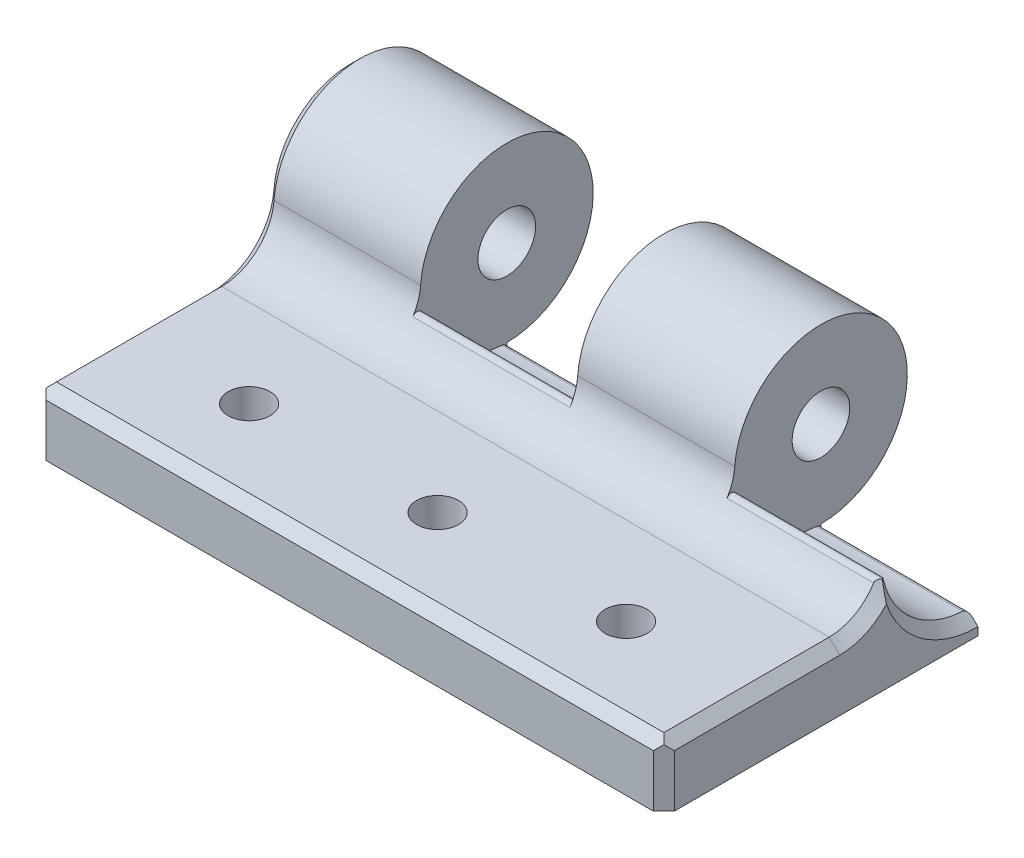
ISO-10303-21;
HEADER;
FILE_DESCRIPTION(('STEP AP214'),'2;1');
FILE_NAME('part.step','',(''),(''),'','','');
FILE_SCHEMA(('AUTOMOTIVE_DESIGN { 1 0 10303 214 1 1 1 1 }'));
ENDSEC;
DATA;
#1=APPLICATION_CONTEXT('core data for automotive mechanical design processes');
#2=APPLICATION_PROTOCOL_DEFINITION('international standard','automotive_design',2000,#1);
#3=PRODUCT_CONTEXT('',#1,'mechanical');
#4=PRODUCT('Part','Part','',(#3));
#5=PRODUCT_RELATED_PRODUCT_CATEGORY('part','',(#4));
#6=PRODUCT_DEFINITION_FORMATION('','',#4);
#7=PRODUCT_DEFINITION_CONTEXT('part definition',#1,'design');
#8=PRODUCT_DEFINITION('design','',#6,#7);
#9=PRODUCT_DEFINITION_SHAPE('','',#8);
#10=(LENGTH_UNIT() NAMED_UNIT(*) SI_UNIT(.MILLI.,.METRE.));
#11=(NAMED_UNIT(*) PLANE_ANGLE_UNIT() SI_UNIT($,.RADIAN.));
#12=(NAMED_UNIT(*) SI_UNIT($,.STERADIAN.) SOLID_ANGLE_UNIT());
#13=UNCERTAINTY_MEASURE_WITH_UNIT(LENGTH_MEASURE(1.E-05),#10,'distance_accuracy_value','');
#14=(GEOMETRIC_REPRESENTATION_CONTEXT(3) GLOBAL_UNCERTAINTY_ASSIGNED_CONTEXT((#13)) GLOBAL_UNIT_ASSIGNED_CONTEXT((#10,
#11,#12)) REPRESENTATION_CONTEXT('',''));
#15=CARTESIAN_POINT('',(0.,0.,0.));
#16=DIRECTION('',(0.,0.,1.));
#17=DIRECTION('',(1.,0.,0.));
#18=AXIS2_PLACEMENT_3D('',#15,#16,#17);
#19=CARTESIAN_POINT('',(30.,0.,0.));
#20=DIRECTION('',(-1.,0.,0.));
#21=DIRECTION('',(0.,0.,1.));
#22=AXIS2_PLACEMENT_3D('',#19,#20,#21);
#23=CYLINDRICAL_SURFACE('',#22,8.25);
#24=CARTESIAN_POINT('',(15.,0.,0.));
#25=DIRECTION('',(1.,0.,0.));
#26=DIRECTION('',(0.,0.,-1.));
#27=AXIS2_PLACEMENT_3D('',#24,#25,#26);
#28=CIRCLE('',#27,8.25);
#29=CARTESIAN_POINT('',(15.,-8.25,0.));
#30=VERTEX_POINT('',#29);
#31=CARTESIAN_POINT('',(15.,0.62264150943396,8.2264705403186));
#32=VERTEX_POINT('',#31);
#33=EDGE_CURVE('E206',#30,#32,#28,.T.);
#34=ORIENTED_EDGE('',*,*,#33,.F.);
#35=DIRECTION('',(-1.,0.,0.));
#36=VECTOR('',#35,1.);
#37=CARTESIAN_POINT('',(30.,-8.25,0.));
#38=LINE('',#37,#36);
#39=CARTESIAN_POINT('',(0.,-8.25,0.));
#40=VERTEX_POINT('',#39);
#41=EDGE_CURVE('E394',#30,#40,#38,.T.);
#42=ORIENTED_EDGE('',*,*,#41,.T.);
#43=CARTESIAN_POINT('',(0.,0.,0.));
#44=DIRECTION('',(-1.,0.,0.));
#45=DIRECTION('',(0.,0.,1.));
#46=AXIS2_PLACEMENT_3D('',#43,#44,#45);
#47=CIRCLE('',#46,8.25);
#48=CARTESIAN_POINT('',(0.,0.62264150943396,8.2264705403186));
#49=VERTEX_POINT('',#48);
#50=EDGE_CURVE('E213',#49,#40,#47,.T.);
#51=ORIENTED_EDGE('',*,*,#50,.F.);
#52=DIRECTION('',(-1.,0.,0.));
#53=VECTOR('',#52,1.);
#54=CARTESIAN_POINT('',(30.,0.62264150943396,8.2264705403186));
#55=LINE('',#54,#53);
#56=EDGE_CURVE('E198',#32,#49,#55,.T.);
#57=ORIENTED_EDGE('',*,*,#56,.F.);
#58=EDGE_LOOP('',(#34,#42,#51,#57));
#59=FACE_BOUND('',#58,.T.);
#60=ADVANCED_FACE('F33',(#59),#23,.T.);
#61=CARTESIAN_POINT('',(30.,0.,0.));
#62=DIRECTION('',(-1.,0.,0.));
#63=DIRECTION('',(0.,0.,1.));
#64=AXIS2_PLACEMENT_3D('',#61,#62,#63);
#65=CYLINDRICAL_SURFACE('',#64,2.75);
#66=CARTESIAN_POINT('',(0.,0.,0.));
#67=DIRECTION('',(-1.,0.,0.));
#68=DIRECTION('',(0.,0.,1.));
#69=AXIS2_PLACEMENT_3D('',#66,#67,#68);
#70=CIRCLE('',#69,2.75);
#71=CARTESIAN_POINT('',(0.,0.,2.75));
#72=VERTEX_POINT('',#71);
#73=EDGE_CURVE('E271',#72,#72,#70,.T.);
#74=ORIENTED_EDGE('',*,*,#73,.T.);
#75=EDGE_LOOP('',(#74));
#76=FACE_BOUND('',#75,.T.);
#77=CARTESIAN_POINT('',(15.,0.,0.));
#78=DIRECTION('',(1.,0.,0.));
#79=DIRECTION('',(0.,0.,-1.));
#80=AXIS2_PLACEMENT_3D('',#77,#78,#79);
#81=CIRCLE('',#80,2.75);
#82=CARTESIAN_POINT('',(15.,0.,-2.75));
#83=VERTEX_POINT('',#82);
#84=EDGE_CURVE('E769',#83,#83,#81,.T.);
#85=ORIENTED_EDGE('',*,*,#84,.T.);
#86=EDGE_LOOP('',(#85));
#87=FACE_BOUND('',#86,.T.);
#88=ADVANCED_FACE('F509',(#76,#87),#65,.F.);
#89=CARTESIAN_POINT('',(30.,0.,0.));
#90=DIRECTION('',(1.,0.,0.));
#91=DIRECTION('',(0.,0.,-1.));
#92=AXIS2_PLACEMENT_3D('',#89,#90,#91);
#93=PLANE('',#92);
#94=DIRECTION('',(0.,0.,1.));
#95=VECTOR('',#94,1.);
#96=CARTESIAN_POINT('',(30.,-5.,30.));
#97=LINE('',#96,#95);
#98=CARTESIAN_POINT('',(30.,-5.,13.2122102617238));
#99=VERTEX_POINT('',#98);
#100=CARTESIAN_POINT('',(30.,-5.,29.));
#101=VERTEX_POINT('',#100);
#102=EDGE_CURVE('E243',#99,#101,#97,.T.);
#103=ORIENTED_EDGE('',*,*,#102,.T.);
#104=DIRECTION('',(0.,-1.,0.));
#105=VECTOR('',#104,1.);
#106=CARTESIAN_POINT('',(30.,-10.,29.));
#107=LINE('',#106,#105);
#108=CARTESIAN_POINT('',(30.,-10.,29.));
#109=VERTEX_POINT('',#108);
#110=EDGE_CURVE('E304',#101,#109,#107,.T.);
#111=ORIENTED_EDGE('',*,*,#110,.T.);
#112=DIRECTION('',(0.,0.,-1.));
#113=VECTOR('',#112,1.);
#114=CARTESIAN_POINT('',(30.,-10.,0.));
#115=LINE('',#114,#113);
#116=CARTESIAN_POINT('',(30.,-10.,0.));
#117=VERTEX_POINT('',#116);
#118=EDGE_CURVE('E451',#109,#117,#115,.T.);
#119=ORIENTED_EDGE('',*,*,#118,.T.);
#120=DIRECTION('',(0.,1.,0.));
#121=VECTOR('',#120,1.);
#122=CARTESIAN_POINT('',(30.,-8.25,0.));
#123=LINE('',#122,#121);
#124=CARTESIAN_POINT('',(30.,-9.24999999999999,0.));
#125=VERTEX_POINT('',#124);
#126=EDGE_CURVE('E441',#117,#125,#123,.T.);
#127=ORIENTED_EDGE('',*,*,#126,.T.);
#128=CARTESIAN_POINT('',(30.,0.,0.));
#129=DIRECTION('',(1.,0.,0.));
#130=DIRECTION('',(0.,0.,-1.));
#131=AXIS2_PLACEMENT_3D('',#128,#129,#130);
#132=CIRCLE('',#131,9.24999999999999);
#133=CARTESIAN_POINT('',(30.,-3.0080084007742,8.7472501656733));
#134=VERTEX_POINT('',#133);
#135=EDGE_CURVE('E302',#125,#134,#132,.F.);
#136=ORIENTED_EDGE('',*,*,#135,.T.);
#137=CARTESIAN_POINT('',(30.,0.999999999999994,13.2122102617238));
#138=DIRECTION('',(1.,0.,0.));
#139=DIRECTION('',(0.,0.,-1.));
#140=AXIS2_PLACEMENT_3D('',#137,#138,#139);
#141=CIRCLE('',#140,5.99999999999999);
#142=EDGE_CURVE('E246',#134,#99,#141,.F.);
#143=ORIENTED_EDGE('',*,*,#142,.T.);
#144=EDGE_LOOP('',(#103,#111,#119,#127,#136,#143));
#145=FACE_BOUND('',#144,.T.);
#146=ADVANCED_FACE('F483',(#145),#93,.T.);
#147=CARTESIAN_POINT('',(-30.,0.,0.));
#148=DIRECTION('',(1.,0.,0.));
#149=DIRECTION('',(0.,0.,-1.));
#150=AXIS2_PLACEMENT_3D('',#147,#148,#149);
#151=PLANE('',#150);
#152=DIRECTION('',(0.,0.,-1.));
#153=VECTOR('',#152,1.);
#154=CARTESIAN_POINT('',(-30.,-10.,0.));
#155=LINE('',#154,#153);
#156=CARTESIAN_POINT('',(-30.,-10.,29.));
#157=VERTEX_POINT('',#156);
#158=CARTESIAN_POINT('',(-30.,-10.,0.));
#159=VERTEX_POINT('',#158);
#160=EDGE_CURVE('E452',#157,#159,#155,.T.);
#161=ORIENTED_EDGE('',*,*,#160,.F.);
#162=DIRECTION('',(0.,1.,0.));
#163=VECTOR('',#162,1.);
#164=CARTESIAN_POINT('',(-30.,0.,29.));
#165=LINE('',#164,#163);
#166=CARTESIAN_POINT('',(-30.,-5.,29.));
#167=VERTEX_POINT('',#166);
#168=EDGE_CURVE('E294',#157,#167,#165,.T.);
#169=ORIENTED_EDGE('',*,*,#168,.T.);
#170=DIRECTION('',(0.,0.,-1.));
#171=VECTOR('',#170,1.);
#172=CARTESIAN_POINT('',(-30.,-5.,0.));
#173=LINE('',#172,#171);
#174=CARTESIAN_POINT('',(-30.,-5.,13.2122102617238));
#175=VERTEX_POINT('',#174);
#176=EDGE_CURVE('E218',#167,#175,#173,.T.);
#177=ORIENTED_EDGE('',*,*,#176,.T.);
#178=CARTESIAN_POINT('',(-30.,0.999999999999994,13.2122102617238));
#179=DIRECTION('',(1.,0.,0.));
#180=DIRECTION('',(0.,0.,-1.));
#181=AXIS2_PLACEMENT_3D('',#178,#179,#180);
#182=CIRCLE('',#181,5.99999999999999);
#183=CARTESIAN_POINT('',(-30.,0.547169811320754,7.22932259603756));
#184=VERTEX_POINT('',#183);
#185=EDGE_CURVE('E238',#175,#184,#182,.T.);
#186=ORIENTED_EDGE('',*,*,#185,.T.);
#187=CARTESIAN_POINT('',(-30.,0.,0.));
#188=DIRECTION('',(1.,0.,0.));
#189=DIRECTION('',(0.,0.,-1.));
#190=AXIS2_PLACEMENT_3D('',#187,#188,#189);
#191=CIRCLE('',#190,7.25000000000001);
#192=CARTESIAN_POINT('',(-30.,-7.25000000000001,0.));
#193=VERTEX_POINT('',#192);
#194=EDGE_CURVE('E240',#184,#193,#191,.F.);
#195=ORIENTED_EDGE('',*,*,#194,.T.);
#196=DIRECTION('',(0.,1.,0.));
#197=VECTOR('',#196,1.);
#198=CARTESIAN_POINT('',(-30.,-8.25,0.));
#199=LINE('',#198,#197);
#200=EDGE_CURVE('E445',#159,#193,#199,.T.);
#201=ORIENTED_EDGE('',*,*,#200,.F.);
#202=EDGE_LOOP('',(#161,#169,#177,#186,#195,#201));
#203=FACE_BOUND('',#202,.T.);
#204=CARTESIAN_POINT('',(-30.,0.,0.));
#205=DIRECTION('',(1.,0.,0.));
#206=DIRECTION('',(0.,0.,-1.));
#207=AXIS2_PLACEMENT_3D('',#204,#205,#206);
#208=CIRCLE('',#207,2.75);
#209=CARTESIAN_POINT('',(-30.,0.,-2.75));
#210=VERTEX_POINT('',#209);
#211=EDGE_CURVE('E227',#210,#210,#208,.T.);
#212=ORIENTED_EDGE('',*,*,#211,.T.);
#213=EDGE_LOOP('',(#212));
#214=FACE_BOUND('',#213,.T.);
#215=ADVANCED_FACE('F454',(#203,#214),#151,.F.);
#216=CARTESIAN_POINT('',(-15.,0.62264150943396,8.2264705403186));
#217=VERTEX_POINT('',#216);
#218=CARTESIAN_POINT('',(-29.,0.62264150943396,8.2264705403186));
#219=VERTEX_POINT('',#218);
#220=EDGE_CURVE('E215',#217,#219,#55,.T.);
#221=ORIENTED_EDGE('',*,*,#220,.F.);
#222=CARTESIAN_POINT('',(-15.,0.,0.));
#223=DIRECTION('',(-1.,0.,0.));
#224=DIRECTION('',(0.,0.,1.));
#225=AXIS2_PLACEMENT_3D('',#222,#223,#224);
#226=CIRCLE('',#225,8.25);
#227=CARTESIAN_POINT('',(-15.,-8.25,0.));
#228=VERTEX_POINT('',#227);
#229=EDGE_CURVE('E424',#217,#228,#226,.T.);
#230=ORIENTED_EDGE('',*,*,#229,.T.);
#231=CARTESIAN_POINT('',(-29.,-8.25,0.));
#232=VERTEX_POINT('',#231);
#233=EDGE_CURVE('E383',#228,#232,#38,.T.);
#234=ORIENTED_EDGE('',*,*,#233,.T.);
#235=CARTESIAN_POINT('',(-29.,0.,0.));
#236=DIRECTION('',(1.,0.,0.));
#237=DIRECTION('',(0.,0.,-1.));
#238=AXIS2_PLACEMENT_3D('',#235,#236,#237);
#239=CIRCLE('',#238,8.25);
#240=EDGE_CURVE('E214',#232,#219,#239,.T.);
#241=ORIENTED_EDGE('',*,*,#240,.T.);
#242=EDGE_LOOP('',(#221,#230,#234,#241));
#243=FACE_BOUND('',#242,.T.);
#244=ADVANCED_FACE('F440',(#243),#23,.T.);
#245=CARTESIAN_POINT('',(30.,0.999999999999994,13.2122102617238));
#246=DIRECTION('',(-1.,0.,0.));
#247=DIRECTION('',(0.,0.,1.));
#248=AXIS2_PLACEMENT_3D('',#245,#246,#247);
#249=CYLINDRICAL_SURFACE('',#248,5.);
#250=DIRECTION('',(-1.,0.,0.));
#251=VECTOR('',#250,1.);
#252=CARTESIAN_POINT('',(30.,-1.63888739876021,8.96529687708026));
#253=LINE('',#252,#251);
#254=CARTESIAN_POINT('',(0.,-1.63888739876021,8.96529687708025));
#255=VERTEX_POINT('',#254);
#256=CARTESIAN_POINT('',(-15.,-1.63888739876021,8.96529687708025));
#257=VERTEX_POINT('',#256);
#258=EDGE_CURVE('E413',#255,#257,#253,.T.);
#259=ORIENTED_EDGE('',*,*,#258,.T.);
#260=CARTESIAN_POINT('',(-15.,0.999999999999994,13.2122102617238));
#261=DIRECTION('',(-1.,0.,0.));
#262=DIRECTION('',(0.,0.,1.));
#263=AXIS2_PLACEMENT_3D('',#260,#261,#262);
#264=CIRCLE('',#263,5.);
#265=EDGE_CURVE('E408',#257,#217,#264,.F.);
#266=ORIENTED_EDGE('',*,*,#265,.T.);
#267=ORIENTED_EDGE('',*,*,#220,.T.);
#268=CARTESIAN_POINT('',(-29.,0.999999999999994,13.2122102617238));
#269=DIRECTION('',(1.,0.,0.));
#270=DIRECTION('',(0.,0.,-1.));
#271=AXIS2_PLACEMENT_3D('',#268,#269,#270);
#272=CIRCLE('',#271,5.);
#273=CARTESIAN_POINT('',(-29.,-4.,13.2122102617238));
#274=VERTEX_POINT('',#273);
#275=EDGE_CURVE('E250',#219,#274,#272,.F.);
#276=ORIENTED_EDGE('',*,*,#275,.T.);
#277=DIRECTION('',(-1.,0.,0.));
#278=VECTOR('',#277,1.);
#279=CARTESIAN_POINT('',(30.,-4.,13.2122102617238));
#280=LINE('',#279,#278);
#281=CARTESIAN_POINT('',(29.,-4.,13.2122102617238));
#282=VERTEX_POINT('',#281);
#283=EDGE_CURVE('E220',#282,#274,#280,.T.);
#284=ORIENTED_EDGE('',*,*,#283,.F.);
#285=CARTESIAN_POINT('',(29.,0.999999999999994,13.2122102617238));
#286=DIRECTION('',(1.,0.,0.));
#287=DIRECTION('',(0.,0.,-1.));
#288=AXIS2_PLACEMENT_3D('',#285,#286,#287);
#289=CIRCLE('',#288,5.);
#290=CARTESIAN_POINT('',(29.,-1.63888739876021,8.96529687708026));
#291=VERTEX_POINT('',#290);
#292=EDGE_CURVE('E248',#282,#291,#289,.T.);
#293=ORIENTED_EDGE('',*,*,#292,.T.);
#294=DIRECTION('',(-1.,0.,0.));
#295=VECTOR('',#294,1.);
#296=CARTESIAN_POINT('',(30.,-1.63888739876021,8.96529687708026));
#297=LINE('',#296,#295);
#298=CARTESIAN_POINT('',(15.,-1.63888739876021,8.96529687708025));
#299=VERTEX_POINT('',#298);
#300=EDGE_CURVE('E202',#291,#299,#297,.T.);
#301=ORIENTED_EDGE('',*,*,#300,.T.);
#302=CARTESIAN_POINT('',(15.,0.999999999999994,13.2122102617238));
#303=DIRECTION('',(1.,0.,0.));
#304=DIRECTION('',(0.,0.,-1.));
#305=AXIS2_PLACEMENT_3D('',#302,#303,#304);
#306=CIRCLE('',#305,5.);
#307=EDGE_CURVE('E193',#299,#32,#306,.T.);
#308=ORIENTED_EDGE('',*,*,#307,.T.);
#309=ORIENTED_EDGE('',*,*,#56,.T.);
#310=CARTESIAN_POINT('',(0.,0.999999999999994,13.2122102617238));
#311=DIRECTION('',(-1.,0.,0.));
#312=DIRECTION('',(0.,0.,1.));
#313=AXIS2_PLACEMENT_3D('',#310,#311,#312);
#314=CIRCLE('',#313,5.);
#315=EDGE_CURVE('E417',#49,#255,#314,.T.);
#316=ORIENTED_EDGE('',*,*,#315,.T.);
#317=EDGE_LOOP('',(#259,#266,#267,#276,#284,#293,#301,#308,#309,#316));
#318=FACE_BOUND('',#317,.T.);
#319=ADVANCED_FACE('F195',(#318),#249,.F.);
#320=CARTESIAN_POINT('',(30.,-4.,13.2122102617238));
#321=DIRECTION('',(0.,-1.,0.));
#322=DIRECTION('',(0.,0.,-1.));
#323=AXIS2_PLACEMENT_3D('',#320,#321,#322);
#324=PLANE('',#323);
#325=ORIENTED_EDGE('',*,*,#283,.T.);
#326=DIRECTION('',(0.,0.,1.));
#327=VECTOR('',#326,1.);
#328=CARTESIAN_POINT('',(-29.,-4.,13.2122102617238));
#329=LINE('',#328,#327);
#330=CARTESIAN_POINT('',(-29.,-4.,29.));
#331=VERTEX_POINT('',#330);
#332=EDGE_CURVE('E257',#274,#331,#329,.T.);
#333=ORIENTED_EDGE('',*,*,#332,.T.);
#334=DIRECTION('',(1.,0.,0.));
#335=VECTOR('',#334,1.);
#336=CARTESIAN_POINT('',(30.,-4.,29.));
#337=LINE('',#336,#335);
#338=CARTESIAN_POINT('',(29.,-4.,29.));
#339=VERTEX_POINT('',#338);
#340=EDGE_CURVE('E252',#331,#339,#337,.T.);
#341=ORIENTED_EDGE('',*,*,#340,.T.);
#342=DIRECTION('',(0.,0.,-1.));
#343=VECTOR('',#342,1.);
#344=CARTESIAN_POINT('',(29.,-4.,13.2122102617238));
#345=LINE('',#344,#343);
#346=EDGE_CURVE('E255',#339,#282,#345,.T.);
#347=ORIENTED_EDGE('',*,*,#346,.T.);
#348=EDGE_LOOP('',(#325,#333,#341,#347));
#349=FACE_BOUND('',#348,.T.);
#350=CARTESIAN_POINT('',(18.,-4.,21.6061051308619));
#351=DIRECTION('',(0.,1.,0.));
#352=DIRECTION('',(0.,0.,1.));
#353=AXIS2_PLACEMENT_3D('',#350,#351,#352);
#354=CIRCLE('',#353,2.);
#355=CARTESIAN_POINT('',(18.,-4.,23.6061051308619));
#356=VERTEX_POINT('',#355);
#357=EDGE_CURVE('E235',#356,#356,#354,.T.);
#358=ORIENTED_EDGE('',*,*,#357,.F.);
#359=EDGE_LOOP('',(#358));
#360=FACE_BOUND('',#359,.T.);
#361=CARTESIAN_POINT('',(0.,-4.,21.6061051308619));
#362=DIRECTION('',(0.,1.,0.));
#363=DIRECTION('',(0.,0.,1.));
#364=AXIS2_PLACEMENT_3D('',#361,#362,#363);
#365=CIRCLE('',#364,2.);
#366=CARTESIAN_POINT('',(0.,-4.,23.6061051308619));
#367=VERTEX_POINT('',#366);
#368=EDGE_CURVE('E232',#367,#367,#365,.T.);
#369=ORIENTED_EDGE('',*,*,#368,.F.);
#370=EDGE_LOOP('',(#369));
#371=FACE_BOUND('',#370,.T.);
#372=CARTESIAN_POINT('',(-18.,-4.,21.6061051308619));
#373=DIRECTION('',(0.,1.,0.));
#374=DIRECTION('',(0.,0.,1.));
#375=AXIS2_PLACEMENT_3D('',#372,#373,#374);
#376=CIRCLE('',#375,2.);
#377=CARTESIAN_POINT('',(-18.,-4.,23.6061051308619));
#378=VERTEX_POINT('',#377);
#379=EDGE_CURVE('E228',#378,#378,#376,.T.);
#380=ORIENTED_EDGE('',*,*,#379,.F.);
#381=EDGE_LOOP('',(#380));
#382=FACE_BOUND('',#381,.T.);
#383=ADVANCED_FACE('F465',(#349,#360,#371,#382),#324,.F.);
#384=CARTESIAN_POINT('',(30.,-10.,30.));
#385=DIRECTION('',(0.,0.,-1.));
#386=DIRECTION('',(0.,1.,0.));
#387=AXIS2_PLACEMENT_3D('',#384,#385,#386);
#388=PLANE('',#387);
#389=DIRECTION('',(-1.,0.,0.));
#390=VECTOR('',#389,1.);
#391=CARTESIAN_POINT('',(30.,-5.,30.));
#392=LINE('',#391,#390);
#393=CARTESIAN_POINT('',(29.,-5.,30.));
#394=VERTEX_POINT('',#393);
#395=CARTESIAN_POINT('',(-29.,-5.,30.));
#396=VERTEX_POINT('',#395);
#397=EDGE_CURVE('E260',#394,#396,#392,.T.);
#398=ORIENTED_EDGE('',*,*,#397,.T.);
#399=DIRECTION('',(0.,-1.,0.));
#400=VECTOR('',#399,1.);
#401=CARTESIAN_POINT('',(-29.,-10.,30.));
#402=LINE('',#401,#400);
#403=CARTESIAN_POINT('',(-29.,-10.,30.));
#404=VERTEX_POINT('',#403);
#405=EDGE_CURVE('E287',#396,#404,#402,.T.);
#406=ORIENTED_EDGE('',*,*,#405,.T.);
#407=DIRECTION('',(-1.,0.,0.));
#408=VECTOR('',#407,1.);
#409=CARTESIAN_POINT('',(30.,-10.,30.));
#410=LINE('',#409,#408);
#411=CARTESIAN_POINT('',(29.,-10.,30.));
#412=VERTEX_POINT('',#411);
#413=EDGE_CURVE('E495',#412,#404,#410,.T.);
#414=ORIENTED_EDGE('',*,*,#413,.F.);
#415=DIRECTION('',(0.,1.,0.));
#416=VECTOR('',#415,1.);
#417=CARTESIAN_POINT('',(29.,-5.,30.));
#418=LINE('',#417,#416);
#419=EDGE_CURVE('E266',#412,#394,#418,.T.);
#420=ORIENTED_EDGE('',*,*,#419,.T.);
#421=EDGE_LOOP('',(#398,#406,#414,#420));
#422=FACE_BOUND('',#421,.T.);
#423=ADVANCED_FACE('F497',(#422),#388,.F.);
#424=CARTESIAN_POINT('',(30.,-10.,0.));
#425=DIRECTION('',(0.,1.,0.));
#426=DIRECTION('',(0.,0.,1.));
#427=AXIS2_PLACEMENT_3D('',#424,#425,#426);
#428=PLANE('',#427);
#429=CARTESIAN_POINT('',(18.,-10.,21.6061051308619));
#430=DIRECTION('',(0.,1.,0.));
#431=DIRECTION('',(0.,0.,1.));
#432=AXIS2_PLACEMENT_3D('',#429,#430,#431);
#433=CIRCLE('',#432,2.);
#434=CARTESIAN_POINT('',(18.,-10.,23.6061051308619));
#435=VERTEX_POINT('',#434);
#436=EDGE_CURVE('E233',#435,#435,#433,.T.);
#437=ORIENTED_EDGE('',*,*,#436,.T.);
#438=EDGE_LOOP('',(#437));
#439=FACE_BOUND('',#438,.T.);
#440=CARTESIAN_POINT('',(0.,-10.,21.6061051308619));
#441=DIRECTION('',(0.,1.,0.));
#442=DIRECTION('',(0.,0.,1.));
#443=AXIS2_PLACEMENT_3D('',#440,#441,#442);
#444=CIRCLE('',#443,2.);
#445=CARTESIAN_POINT('',(0.,-10.,23.6061051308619));
#446=VERTEX_POINT('',#445);
#447=EDGE_CURVE('E229',#446,#446,#444,.T.);
#448=ORIENTED_EDGE('',*,*,#447,.T.);
#449=EDGE_LOOP('',(#448));
#450=FACE_BOUND('',#449,.T.);
#451=CARTESIAN_POINT('',(-18.,-10.,21.6061051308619));
#452=DIRECTION('',(0.,1.,0.));
#453=DIRECTION('',(0.,0.,1.));
#454=AXIS2_PLACEMENT_3D('',#451,#452,#453);
#455=CIRCLE('',#454,2.);
#456=CARTESIAN_POINT('',(-18.,-10.,23.6061051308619));
#457=VERTEX_POINT('',#456);
#458=EDGE_CURVE('E224',#457,#457,#455,.T.);
#459=ORIENTED_EDGE('',*,*,#458,.T.);
#460=EDGE_LOOP('',(#459));
#461=FACE_BOUND('',#460,.T.);
#462=ORIENTED_EDGE('',*,*,#413,.T.);
#463=DIRECTION('',(0.707106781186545,0.,0.70710678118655));
#464=VECTOR('',#463,1.);
#465=CARTESIAN_POINT('',(-29.,-10.,30.));
#466=LINE('',#465,#464);
#467=EDGE_CURVE('E292',#404,#157,#466,.F.);
#468=ORIENTED_EDGE('',*,*,#467,.T.);
#469=ORIENTED_EDGE('',*,*,#160,.T.);
#470=DIRECTION('',(-1.,0.,0.));
#471=VECTOR('',#470,1.);
#472=CARTESIAN_POINT('',(30.,-10.,0.));
#473=LINE('',#472,#471);
#474=EDGE_CURVE('E448',#117,#159,#473,.T.);
#475=ORIENTED_EDGE('',*,*,#474,.F.);
#476=ORIENTED_EDGE('',*,*,#118,.F.);
#477=DIRECTION('',(-0.70710678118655,0.,0.707106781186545));
#478=VECTOR('',#477,1.);
#479=CARTESIAN_POINT('',(30.,-10.,29.));
#480=LINE('',#479,#478);
#481=EDGE_CURVE('E290',#109,#412,#480,.T.);
#482=ORIENTED_EDGE('',*,*,#481,.T.);
#483=EDGE_LOOP('',(#462,#468,#469,#475,#476,#482));
#484=FACE_BOUND('',#483,.T.);
#485=ADVANCED_FACE('F487',(#439,#450,#461,#484),#428,.F.);
#486=CARTESIAN_POINT('',(30.,-8.25,0.));
#487=DIRECTION('',(0.,0.,1.));
#488=DIRECTION('',(0.,-1.,0.));
#489=AXIS2_PLACEMENT_3D('',#486,#487,#488);
#490=PLANE('',#489);
#491=ORIENTED_EDGE('',*,*,#41,.F.);
#492=DIRECTION('',(0.,-1.,0.));
#493=VECTOR('',#492,1.);
#494=CARTESIAN_POINT('',(15.,0.,0.));
#495=LINE('',#494,#493);
#496=CARTESIAN_POINT('',(15.,-8.73570260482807,0.));
#497=VERTEX_POINT('',#496);
#498=EDGE_CURVE('E56',#30,#497,#495,.T.);
#499=ORIENTED_EDGE('',*,*,#498,.T.);
#500=DIRECTION('',(1.,0.,0.));
#501=VECTOR('',#500,1.);
#502=CARTESIAN_POINT('',(30.,-8.73570260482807,0.));
#503=LINE('',#502,#501);
#504=CARTESIAN_POINT('',(29.4857026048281,-8.73570260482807,0.));
#505=VERTEX_POINT('',#504);
#506=EDGE_CURVE('E385',#497,#505,#503,.T.);
#507=ORIENTED_EDGE('',*,*,#506,.T.);
#508=DIRECTION('',(0.707106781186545,-0.70710678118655,0.));
#509=VECTOR('',#508,1.);
#510=CARTESIAN_POINT('',(20.7500000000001,0.,0.));
#511=LINE('',#510,#509);
#512=EDGE_CURVE('E312',#505,#125,#511,.T.);
#513=ORIENTED_EDGE('',*,*,#512,.T.);
#514=ORIENTED_EDGE('',*,*,#126,.F.);
#515=ORIENTED_EDGE('',*,*,#474,.T.);
#516=ORIENTED_EDGE('',*,*,#200,.T.);
#517=DIRECTION('',(0.707106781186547,-0.707106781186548,0.));
#518=VECTOR('',#517,1.);
#519=CARTESIAN_POINT('',(-37.25,0.,0.));
#520=LINE('',#519,#518);
#521=EDGE_CURVE('E263',#193,#232,#520,.T.);
#522=ORIENTED_EDGE('',*,*,#521,.T.);
#523=ORIENTED_EDGE('',*,*,#233,.F.);
#524=DIRECTION('',(0.,-1.,0.));
#525=VECTOR('',#524,1.);
#526=CARTESIAN_POINT('',(-15.,-8.25,0.));
#527=LINE('',#526,#525);
#528=CARTESIAN_POINT('',(-15.,-8.73570260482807,0.));
#529=VERTEX_POINT('',#528);
#530=EDGE_CURVE('E48',#228,#529,#527,.T.);
#531=ORIENTED_EDGE('',*,*,#530,.T.);
#532=DIRECTION('',(-1.,0.,0.));
#533=VECTOR('',#532,1.);
#534=CARTESIAN_POINT('',(30.,-8.73570260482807,0.));
#535=LINE('',#534,#533);
#536=CARTESIAN_POINT('',(0.,-8.73570260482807,0.));
#537=VERTEX_POINT('',#536);
#538=EDGE_CURVE('E381',#529,#537,#535,.F.);
#539=ORIENTED_EDGE('',*,*,#538,.T.);
#540=DIRECTION('',(0.,1.,0.));
#541=VECTOR('',#540,1.);
#542=CARTESIAN_POINT('',(0.,0.,0.));
#543=LINE('',#542,#541);
#544=EDGE_CURVE('E387',#537,#40,#543,.T.);
#545=ORIENTED_EDGE('',*,*,#544,.T.);
#546=EDGE_LOOP('',(#491,#499,#507,#513,#514,#515,#516,#522,#523,#531,#539,#545));
#547=FACE_BOUND('',#546,.T.);
#548=ADVANCED_FACE('F380',(#547),#490,.F.);
#549=CARTESIAN_POINT('',(-15.,0.,0.));
#550=DIRECTION('',(-1.,0.,0.));
#551=DIRECTION('',(0.,0.,1.));
#552=AXIS2_PLACEMENT_3D('',#549,#550,#551);
#553=CIRCLE('',#552,2.75);
#554=CARTESIAN_POINT('',(-15.,0.,2.75));
#555=VERTEX_POINT('',#554);
#556=EDGE_CURVE('E281',#555,#555,#553,.T.);
#557=ORIENTED_EDGE('',*,*,#556,.F.);
#558=EDGE_LOOP('',(#557));
#559=FACE_BOUND('',#558,.T.);
#560=ORIENTED_EDGE('',*,*,#211,.F.);
#561=EDGE_LOOP('',(#560));
#562=FACE_BOUND('',#561,.T.);
#563=ADVANCED_FACE('F516',(#559,#562),#65,.F.);
#564=CARTESIAN_POINT('',(-18.,-64.,21.6061051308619));
#565=DIRECTION('',(0.,1.,0.));
#566=DIRECTION('',(0.,0.,1.));
#567=AXIS2_PLACEMENT_3D('',#564,#565,#566);
#568=CYLINDRICAL_SURFACE('',#567,2.);
#569=ORIENTED_EDGE('',*,*,#379,.T.);
#570=EDGE_LOOP('',(#569));
#571=FACE_BOUND('',#570,.T.);
#572=ORIENTED_EDGE('',*,*,#458,.F.);
#573=EDGE_LOOP('',(#572));
#574=FACE_BOUND('',#573,.T.);
#575=ADVANCED_FACE('F562',(#571,#574),#568,.F.);
#576=CARTESIAN_POINT('',(0.,-64.,21.6061051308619));
#577=DIRECTION('',(0.,1.,0.));
#578=DIRECTION('',(0.,0.,1.));
#579=AXIS2_PLACEMENT_3D('',#576,#577,#578);
#580=CYLINDRICAL_SURFACE('',#579,2.);
#581=ORIENTED_EDGE('',*,*,#368,.T.);
#582=EDGE_LOOP('',(#581));
#583=FACE_BOUND('',#582,.T.);
#584=ORIENTED_EDGE('',*,*,#447,.F.);
#585=EDGE_LOOP('',(#584));
#586=FACE_BOUND('',#585,.T.);
#587=ADVANCED_FACE('F569',(#583,#586),#580,.F.);
#588=CARTESIAN_POINT('',(18.,-64.,21.6061051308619));
#589=DIRECTION('',(0.,1.,0.));
#590=DIRECTION('',(0.,0.,1.));
#591=AXIS2_PLACEMENT_3D('',#588,#589,#590);
#592=CYLINDRICAL_SURFACE('',#591,2.);
#593=ORIENTED_EDGE('',*,*,#357,.T.);
#594=EDGE_LOOP('',(#593));
#595=FACE_BOUND('',#594,.T.);
#596=ORIENTED_EDGE('',*,*,#436,.F.);
#597=EDGE_LOOP('',(#596));
#598=FACE_BOUND('',#597,.T.);
#599=ADVANCED_FACE('F577',(#595,#598),#592,.F.);
#600=CARTESIAN_POINT('',(30.,0.999999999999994,13.2122102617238));
#601=DIRECTION('',(1.,0.,0.));
#602=DIRECTION('',(0.,0.,-1.));
#603=AXIS2_PLACEMENT_3D('',#600,#601,#602);
#604=CONICAL_SURFACE('',#603,5.99999999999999,0.785398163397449);
#605=CARTESIAN_POINT('',(30.,-3.0080084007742,8.7472501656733));
#606=CARTESIAN_POINT('',(29.9491024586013,-2.90955812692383,8.72727869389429));
#607=CARTESIAN_POINT('',(29.899428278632,-2.81042661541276,8.70755658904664));
#608=CARTESIAN_POINT('',(29.8028246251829,-2.61069344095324,8.6686762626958));
#609=CARTESIAN_POINT('',(29.755895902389,-2.51009138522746,8.64951819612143));
#610=CARTESIAN_POINT('',(29.6194221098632,-2.20534283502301,8.59288207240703));
#611=CARTESIAN_POINT('',(29.5345229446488,-1.99889009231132,8.55637228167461));
#612=CARTESIAN_POINT('',(29.381972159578,-1.58456548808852,8.48748792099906));
#613=CARTESIAN_POINT('',(29.3139647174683,-1.37683881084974,8.45503681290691));
#614=CARTESIAN_POINT('',(29.1959628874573,-0.95601904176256,8.39415935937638));
#615=CARTESIAN_POINT('',(29.1459403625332,-0.742934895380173,8.36572676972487));
#616=CARTESIAN_POINT('',(29.071768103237,-0.339340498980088,8.31693446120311));
#617=CARTESIAN_POINT('',(29.0451565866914,-0.149359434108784,8.29600923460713));
#618=CARTESIAN_POINT('',(29.0182159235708,0.138064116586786,8.26762785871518));
#619=CARTESIAN_POINT('',(29.0113974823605,0.234776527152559,8.2586307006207));
#620=CARTESIAN_POINT('',(29.0022848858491,0.428520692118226,8.2417251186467));
#621=CARTESIAN_POINT('',(28.9999912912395,0.525552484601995,8.23381682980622));
#622=CARTESIAN_POINT('',(29.,0.622641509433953,8.22647054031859));
#623=B_SPLINE_CURVE_WITH_KNOTS('',3,(#605,#606,#607,#608,#609,#610,#611,#612,#613,#614,#615,
#616,#617,#618,#619,#620,#621,#622),.UNSPECIFIED.,.F.,.F.,(4,2,2,2,2,2,2,2,4),(0.,
0.337824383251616,0.675740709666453,1.35375990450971,2.01597893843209,2.67715738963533,
3.25522805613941,3.54723507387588,3.83927827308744),.UNSPECIFIED.);
#624=CARTESIAN_POINT('',(29.3273230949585,-1.40919077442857,8.46077140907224));
#625=VERTEX_POINT('',#624);
#626=EDGE_CURVE('E203',#134,#625,#623,.T.);
#627=ORIENTED_EDGE('',*,*,#626,.T.);
#628=CARTESIAN_POINT('',(29.3273230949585,-1.40919077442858,8.46077140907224));
#629=CARTESIAN_POINT('',(29.312834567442,-1.40676621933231,8.47578719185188));
#630=CARTESIAN_POINT('',(29.2984641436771,-1.4050028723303,8.49101128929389));
#631=CARTESIAN_POINT('',(29.2700158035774,-1.40288624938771,8.5218753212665));
#632=CARTESIAN_POINT('',(29.2559384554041,-1.40253549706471,8.53751594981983));
#633=CARTESIAN_POINT('',(29.2140187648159,-1.40375218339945,8.58530955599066));
#634=CARTESIAN_POINT('',(29.1867949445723,-1.40764334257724,8.61801949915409));
#635=CARTESIAN_POINT('',(29.1434424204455,-1.42027235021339,8.67376254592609));
#636=CARTESIAN_POINT('',(29.1265130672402,-1.42710583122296,8.69661081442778));
#637=CARTESIAN_POINT('',(29.0947332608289,-1.44458614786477,8.7422382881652));
#638=CARTESIAN_POINT('',(29.0798759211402,-1.45521991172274,8.76501746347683));
#639=CARTESIAN_POINT('',(29.0558767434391,-1.47805445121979,8.80523408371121));
#640=CARTESIAN_POINT('',(29.0461894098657,-1.48946249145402,8.82279242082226));
#641=CARTESIAN_POINT('',(29.0291965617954,-1.51503079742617,8.85700407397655));
#642=CARTESIAN_POINT('',(29.0218850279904,-1.52918396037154,8.87365958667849));
#643=CARTESIAN_POINT('',(29.0108736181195,-1.55841165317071,8.90364441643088));
#644=CARTESIAN_POINT('',(29.0068569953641,-1.5731971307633,8.91713645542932));
#645=CARTESIAN_POINT('',(29.0013914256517,-1.60469234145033,8.94256005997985));
#646=CARTESIAN_POINT('',(28.9999650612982,-1.621417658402,8.95447706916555));
#647=CARTESIAN_POINT('',(29.,-1.63888739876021,8.96529687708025));
#648=B_SPLINE_CURVE_WITH_KNOTS('',3,(#628,#629,#630,#631,#632,#633,#634,#635,#636,#637,#638,
#639,#640,#641,#642,#643,#644,#645,#646,#647),.UNSPECIFIED.,.F.,.F.,(4,2,2,2,2,2,2,2,2,4),(0.,
0.0629860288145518,0.12608453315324,0.253597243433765,0.341091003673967,0.428286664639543,
0.497247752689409,0.56603273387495,0.626974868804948,0.688445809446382),.UNSPECIFIED.);
#649=EDGE_CURVE('E344',#625,#291,#648,.T.);
#650=ORIENTED_EDGE('',*,*,#649,.T.);
#651=ORIENTED_EDGE('',*,*,#292,.F.);
#652=DIRECTION('',(-0.707106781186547,0.707106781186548,0.));
#653=VECTOR('',#652,1.);
#654=CARTESIAN_POINT('',(30.,-5.,13.2122102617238));
#655=LINE('',#654,#653);
#656=EDGE_CURVE('E278',#99,#282,#655,.T.);
#657=ORIENTED_EDGE('',*,*,#656,.F.);
#658=ORIENTED_EDGE('',*,*,#142,.F.);
#659=EDGE_LOOP('',(#627,#650,#651,#657,#658));
#660=FACE_BOUND('',#659,.T.);
#661=ADVANCED_FACE('F321',(#660),#604,.F.);
#662=CARTESIAN_POINT('',(30.,-5.,0.));
#663=DIRECTION('',(0.707106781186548,0.707106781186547,0.));
#664=DIRECTION('',(0.,0.,-1.));
#665=AXIS2_PLACEMENT_3D('',#662,#663,#664);
#666=PLANE('',#665);
#667=DIRECTION('',(0.577350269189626,-0.577350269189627,0.577350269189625));
#668=VECTOR('',#667,1.);
#669=CARTESIAN_POINT('',(30.,-5.,30.));
#670=LINE('',#669,#668);
#671=CARTESIAN_POINT('',(29.5,-4.5,29.5));
#672=VERTEX_POINT('',#671);
#673=EDGE_CURVE('E276',#672,#339,#670,.F.);
#674=ORIENTED_EDGE('',*,*,#673,.F.);
#675=DIRECTION('',(0.577350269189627,-0.577350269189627,-0.577350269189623));
#676=VECTOR('',#675,1.);
#677=CARTESIAN_POINT('',(39.6666666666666,-14.6666666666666,19.3333333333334));
#678=LINE('',#677,#676);
#679=EDGE_CURVE('E307',#672,#101,#678,.T.);
#680=ORIENTED_EDGE('',*,*,#679,.T.);
#681=ORIENTED_EDGE('',*,*,#102,.F.);
#682=ORIENTED_EDGE('',*,*,#656,.T.);
#683=ORIENTED_EDGE('',*,*,#346,.F.);
#684=EDGE_LOOP('',(#674,#680,#681,#682,#683));
#685=FACE_BOUND('',#684,.T.);
#686=ADVANCED_FACE('F476',(#685),#666,.T.);
#687=CARTESIAN_POINT('',(30.,-5.,30.));
#688=DIRECTION('',(0.,-0.707106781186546,-0.707106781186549));
#689=DIRECTION('',(-1.,0.,0.));
#690=AXIS2_PLACEMENT_3D('',#687,#688,#689);
#691=PLANE('',#690);
#692=DIRECTION('',(-0.577350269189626,-0.577350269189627,0.577350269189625));
#693=VECTOR('',#692,1.);
#694=CARTESIAN_POINT('',(-9.99999999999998,15.,10.));
#695=LINE('',#694,#693);
#696=CARTESIAN_POINT('',(-29.5,-4.49999999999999,29.5));
#697=VERTEX_POINT('',#696);
#698=EDGE_CURVE('E274',#697,#331,#695,.F.);
#699=ORIENTED_EDGE('',*,*,#698,.F.);
#700=DIRECTION('',(0.577350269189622,-0.577350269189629,0.577350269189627));
#701=VECTOR('',#700,1.);
#702=CARTESIAN_POINT('',(-9.3333333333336,-24.6666666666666,49.6666666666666));
#703=LINE('',#702,#701);
#704=EDGE_CURVE('E300',#697,#396,#703,.T.);
#705=ORIENTED_EDGE('',*,*,#704,.T.);
#706=ORIENTED_EDGE('',*,*,#397,.F.);
#707=DIRECTION('',(-0.577350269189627,-0.577350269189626,0.577350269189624));
#708=VECTOR('',#707,1.);
#709=CARTESIAN_POINT('',(29.3333333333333,-4.66666666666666,29.6666666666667));
#710=LINE('',#709,#708);
#711=EDGE_CURVE('E298',#394,#672,#710,.F.);
#712=ORIENTED_EDGE('',*,*,#711,.T.);
#713=ORIENTED_EDGE('',*,*,#673,.T.);
#714=ORIENTED_EDGE('',*,*,#340,.F.);
#715=EDGE_LOOP('',(#699,#705,#706,#712,#713,#714));
#716=FACE_BOUND('',#715,.T.);
#717=ADVANCED_FACE('F469',(#716),#691,.F.);
#718=CARTESIAN_POINT('',(-29.,-4.,13.2122102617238));
#719=DIRECTION('',(0.707106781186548,-0.707106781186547,0.));
#720=DIRECTION('',(0.,0.,1.));
#721=AXIS2_PLACEMENT_3D('',#718,#719,#720);
#722=PLANE('',#721);
#723=ORIENTED_EDGE('',*,*,#176,.F.);
#724=DIRECTION('',(0.577350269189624,0.577350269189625,0.577350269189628));
#725=VECTOR('',#724,1.);
#726=CARTESIAN_POINT('',(-34.5959299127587,-9.59592991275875,24.4040700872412));
#727=LINE('',#726,#725);
#728=EDGE_CURVE('E296',#167,#697,#727,.T.);
#729=ORIENTED_EDGE('',*,*,#728,.T.);
#730=ORIENTED_EDGE('',*,*,#698,.T.);
#731=ORIENTED_EDGE('',*,*,#332,.F.);
#732=DIRECTION('',(0.707106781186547,0.707106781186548,0.));
#733=VECTOR('',#732,1.);
#734=CARTESIAN_POINT('',(-30.,-5.,13.2122102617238));
#735=LINE('',#734,#733);
#736=EDGE_CURVE('E270',#175,#274,#735,.T.);
#737=ORIENTED_EDGE('',*,*,#736,.F.);
#738=EDGE_LOOP('',(#723,#729,#730,#731,#737));
#739=FACE_BOUND('',#738,.T.);
#740=ADVANCED_FACE('F461',(#739),#722,.F.);
#741=CARTESIAN_POINT('',(-29.,0.999999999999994,13.2122102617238));
#742=DIRECTION('',(-1.,0.,0.));
#743=DIRECTION('',(0.,0.,1.));
#744=AXIS2_PLACEMENT_3D('',#741,#742,#743);
#745=CONICAL_SURFACE('',#744,5.,0.785398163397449);
#746=ORIENTED_EDGE('',*,*,#736,.T.);
#747=ORIENTED_EDGE('',*,*,#275,.F.);
#748=DIRECTION('',(0.707106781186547,0.0533665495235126,0.705090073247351));
#749=VECTOR('',#748,1.);
#750=CARTESIAN_POINT('',(-30.,0.547169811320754,7.22932259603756));
#751=LINE('',#750,#749);
#752=EDGE_CURVE('E267',#184,#219,#751,.T.);
#753=ORIENTED_EDGE('',*,*,#752,.F.);
#754=ORIENTED_EDGE('',*,*,#185,.F.);
#755=EDGE_LOOP('',(#746,#747,#753,#754));
#756=FACE_BOUND('',#755,.T.);
#757=ADVANCED_FACE('F438',(#756),#745,.F.);
#758=CARTESIAN_POINT('',(-29.,0.,0.));
#759=DIRECTION('',(1.,0.,0.));
#760=DIRECTION('',(0.,0.,-1.));
#761=AXIS2_PLACEMENT_3D('',#758,#759,#760);
#762=CONICAL_SURFACE('',#761,8.25,0.785398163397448);
#763=ORIENTED_EDGE('',*,*,#521,.F.);
#764=ORIENTED_EDGE('',*,*,#194,.F.);
#765=ORIENTED_EDGE('',*,*,#752,.T.);
#766=ORIENTED_EDGE('',*,*,#240,.F.);
#767=EDGE_LOOP('',(#763,#764,#765,#766));
#768=FACE_BOUND('',#767,.T.);
#769=ADVANCED_FACE('F435',(#768),#762,.T.);
#770=CARTESIAN_POINT('',(0.,0.,0.));
#771=DIRECTION('',(-1.,0.,0.));
#772=DIRECTION('',(0.,0.,1.));
#773=AXIS2_PLACEMENT_3D('',#770,#771,#772);
#774=CYLINDRICAL_SURFACE('',#773,8.25);
#775=CARTESIAN_POINT('',(0.,-8.2365195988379,0.471428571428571));
#776=VERTEX_POINT('',#775);
#777=CARTESIAN_POINT('',(0.,-1.79404607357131,8.05257093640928));
#778=VERTEX_POINT('',#777);
#779=EDGE_CURVE('E765',#776,#778,#47,.T.);
#780=ORIENTED_EDGE('',*,*,#779,.F.);
#781=DIRECTION('',(-1.,0.,0.));
#782=VECTOR('',#781,1.);
#783=CARTESIAN_POINT('',(0.,-8.2365195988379,0.471428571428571));
#784=LINE('',#783,#782);
#785=CARTESIAN_POINT('',(-15.,-8.2365195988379,0.471428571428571));
#786=VERTEX_POINT('',#785);
#787=EDGE_CURVE('E366',#776,#786,#784,.T.);
#788=ORIENTED_EDGE('',*,*,#787,.T.);
#789=CARTESIAN_POINT('',(-15.,-1.79404607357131,8.05257093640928));
#790=VERTEX_POINT('',#789);
#791=EDGE_CURVE('E374',#786,#790,#226,.T.);
#792=ORIENTED_EDGE('',*,*,#791,.T.);
#793=DIRECTION('',(-1.,0.,0.));
#794=VECTOR('',#793,1.);
#795=CARTESIAN_POINT('',(0.,-1.79404607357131,8.05257093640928));
#796=LINE('',#795,#794);
#797=EDGE_CURVE('E406',#790,#778,#796,.F.);
#798=ORIENTED_EDGE('',*,*,#797,.T.);
#799=EDGE_LOOP('',(#780,#788,#792,#798));
#800=FACE_BOUND('',#799,.T.);
#801=ADVANCED_FACE('F621',(#800),#774,.F.);
#802=CARTESIAN_POINT('',(0.,0.,0.));
#803=DIRECTION('',(-1.,0.,0.));
#804=DIRECTION('',(0.,0.,1.));
#805=AXIS2_PLACEMENT_3D('',#802,#803,#804);
#806=PLANE('',#805);
#807=ORIENTED_EDGE('',*,*,#73,.F.);
#808=EDGE_LOOP('',(#807));
#809=FACE_BOUND('',#808,.T.);
#810=ORIENTED_EDGE('',*,*,#50,.T.);
#811=ORIENTED_EDGE('',*,*,#544,.F.);
#812=CARTESIAN_POINT('',(0.,-8.73570260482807,0.5));
#813=DIRECTION('',(-1.,0.,0.));
#814=DIRECTION('',(0.,0.,1.));
#815=AXIS2_PLACEMENT_3D('',#812,#813,#814);
#816=CIRCLE('',#815,0.5);
#817=EDGE_CURVE('E11',#537,#776,#816,.F.);
#818=ORIENTED_EDGE('',*,*,#817,.T.);
#819=ORIENTED_EDGE('',*,*,#779,.T.);
#820=CARTESIAN_POINT('',(0.,-1.90277613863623,8.5406055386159));
#821=DIRECTION('',(-1.,0.,0.));
#822=DIRECTION('',(0.,0.,1.));
#823=AXIS2_PLACEMENT_3D('',#820,#821,#822);
#824=CIRCLE('',#823,0.5);
#825=EDGE_CURVE('E421',#778,#255,#824,.F.);
#826=ORIENTED_EDGE('',*,*,#825,.T.);
#827=ORIENTED_EDGE('',*,*,#315,.F.);
#828=EDGE_LOOP('',(#810,#811,#818,#819,#826,#827));
#829=FACE_BOUND('',#828,.T.);
#830=ADVANCED_FACE('F626',(#809,#829),#806,.T.);
#831=CARTESIAN_POINT('',(-15.,0.,0.));
#832=DIRECTION('',(-1.,0.,0.));
#833=DIRECTION('',(0.,0.,1.));
#834=AXIS2_PLACEMENT_3D('',#831,#832,#833);
#835=PLANE('',#834);
#836=ORIENTED_EDGE('',*,*,#556,.T.);
#837=EDGE_LOOP('',(#836));
#838=FACE_BOUND('',#837,.T.);
#839=ORIENTED_EDGE('',*,*,#229,.F.);
#840=ORIENTED_EDGE('',*,*,#265,.F.);
#841=CARTESIAN_POINT('',(-15.,-1.90277613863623,8.5406055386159));
#842=DIRECTION('',(-1.,0.,0.));
#843=DIRECTION('',(0.,0.,1.));
#844=AXIS2_PLACEMENT_3D('',#841,#842,#843);
#845=CIRCLE('',#844,0.5);
#846=EDGE_CURVE('E422',#257,#790,#845,.T.);
#847=ORIENTED_EDGE('',*,*,#846,.T.);
#848=ORIENTED_EDGE('',*,*,#791,.F.);
#849=CARTESIAN_POINT('',(-15.,-8.73570260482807,0.5));
#850=DIRECTION('',(-1.,0.,0.));
#851=DIRECTION('',(0.,0.,1.));
#852=AXIS2_PLACEMENT_3D('',#849,#850,#851);
#853=CIRCLE('',#852,0.5);
#854=EDGE_CURVE('E41',#786,#529,#853,.T.);
#855=ORIENTED_EDGE('',*,*,#854,.T.);
#856=ORIENTED_EDGE('',*,*,#530,.F.);
#857=EDGE_LOOP('',(#839,#840,#847,#848,#855,#856));
#858=FACE_BOUND('',#857,.T.);
#859=ADVANCED_FACE('F372',(#838,#858),#835,.F.);
#860=CARTESIAN_POINT('',(15.,0.,0.));
#861=DIRECTION('',(1.,0.,0.));
#862=DIRECTION('',(0.,0.,-1.));
#863=AXIS2_PLACEMENT_3D('',#860,#861,#862);
#864=CYLINDRICAL_SURFACE('',#863,8.25);
#865=CARTESIAN_POINT('',(29.,0.,0.));
#866=DIRECTION('',(1.,0.,0.));
#867=DIRECTION('',(0.,0.,-1.));
#868=AXIS2_PLACEMENT_3D('',#865,#866,#867);
#869=CIRCLE('',#868,8.25);
#870=CARTESIAN_POINT('',(29.,-1.79404607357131,8.05257093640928));
#871=VERTEX_POINT('',#870);
#872=CARTESIAN_POINT('',(29.,-8.2365195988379,0.471428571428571));
#873=VERTEX_POINT('',#872);
#874=EDGE_CURVE('E309',#871,#873,#869,.T.);
#875=ORIENTED_EDGE('',*,*,#874,.T.);
#876=DIRECTION('',(1.,0.,0.));
#877=VECTOR('',#876,1.);
#878=CARTESIAN_POINT('',(15.,-8.2365195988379,0.471428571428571));
#879=LINE('',#878,#877);
#880=CARTESIAN_POINT('',(15.,-8.2365195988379,0.471428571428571));
#881=VERTEX_POINT('',#880);
#882=EDGE_CURVE('E389',#873,#881,#879,.F.);
#883=ORIENTED_EDGE('',*,*,#882,.T.);
#884=CARTESIAN_POINT('',(15.,-1.79404607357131,8.05257093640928));
#885=VERTEX_POINT('',#884);
#886=EDGE_CURVE('E210',#885,#881,#28,.T.);
#887=ORIENTED_EDGE('',*,*,#886,.F.);
#888=DIRECTION('',(1.,0.,0.));
#889=VECTOR('',#888,1.);
#890=CARTESIAN_POINT('',(15.,-1.79404607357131,8.05257093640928));
#891=LINE('',#890,#889);
#892=EDGE_CURVE('E345',#885,#871,#891,.T.);
#893=ORIENTED_EDGE('',*,*,#892,.T.);
#894=EDGE_LOOP('',(#875,#883,#887,#893));
#895=FACE_BOUND('',#894,.T.);
#896=ADVANCED_FACE('F402',(#895),#864,.F.);
#897=CARTESIAN_POINT('',(15.,0.,0.));
#898=DIRECTION('',(1.,0.,0.));
#899=DIRECTION('',(0.,0.,-1.));
#900=AXIS2_PLACEMENT_3D('',#897,#898,#899);
#901=PLANE('',#900);
#902=ORIENTED_EDGE('',*,*,#84,.F.);
#903=EDGE_LOOP('',(#902));
#904=FACE_BOUND('',#903,.T.);
#905=ORIENTED_EDGE('',*,*,#33,.T.);
#906=ORIENTED_EDGE('',*,*,#307,.F.);
#907=CARTESIAN_POINT('',(15.,-1.90277613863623,8.5406055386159));
#908=DIRECTION('',(1.,0.,0.));
#909=DIRECTION('',(0.,0.,-1.));
#910=AXIS2_PLACEMENT_3D('',#907,#908,#909);
#911=CIRCLE('',#910,0.5);
#912=EDGE_CURVE('E791',#299,#885,#911,.F.);
#913=ORIENTED_EDGE('',*,*,#912,.T.);
#914=ORIENTED_EDGE('',*,*,#886,.T.);
#915=CARTESIAN_POINT('',(15.,-8.73570260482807,0.5));
#916=DIRECTION('',(1.,0.,0.));
#917=DIRECTION('',(0.,0.,-1.));
#918=AXIS2_PLACEMENT_3D('',#915,#916,#917);
#919=CIRCLE('',#918,0.5);
#920=EDGE_CURVE('E370',#881,#497,#919,.F.);
#921=ORIENTED_EDGE('',*,*,#920,.T.);
#922=ORIENTED_EDGE('',*,*,#498,.F.);
#923=EDGE_LOOP('',(#905,#906,#913,#914,#921,#922));
#924=FACE_BOUND('',#923,.T.);
#925=ADVANCED_FACE('F207',(#904,#924),#901,.T.);
#926=CARTESIAN_POINT('',(-29.,-10.,30.));
#927=DIRECTION('',(0.70710678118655,0.,-0.707106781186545));
#928=DIRECTION('',(0.,-1.,0.));
#929=AXIS2_PLACEMENT_3D('',#926,#927,#928);
#930=PLANE('',#929);
#931=ORIENTED_EDGE('',*,*,#728,.F.);
#932=ORIENTED_EDGE('',*,*,#168,.F.);
#933=ORIENTED_EDGE('',*,*,#467,.F.);
#934=ORIENTED_EDGE('',*,*,#405,.F.);
#935=ORIENTED_EDGE('',*,*,#704,.F.);
#936=EDGE_LOOP('',(#931,#932,#933,#934,#935));
#937=FACE_BOUND('',#936,.T.);
#938=ADVANCED_FACE('F500',(#937),#930,.F.);
#939=CARTESIAN_POINT('',(30.,0.,29.));
#940=DIRECTION('',(0.707106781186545,0.,0.70710678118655));
#941=DIRECTION('',(0.,1.,0.));
#942=AXIS2_PLACEMENT_3D('',#939,#940,#941);
#943=PLANE('',#942);
#944=ORIENTED_EDGE('',*,*,#711,.F.);
#945=ORIENTED_EDGE('',*,*,#419,.F.);
#946=ORIENTED_EDGE('',*,*,#481,.F.);
#947=ORIENTED_EDGE('',*,*,#110,.F.);
#948=ORIENTED_EDGE('',*,*,#679,.F.);
#949=EDGE_LOOP('',(#944,#945,#946,#947,#948));
#950=FACE_BOUND('',#949,.T.);
#951=ADVANCED_FACE('F331',(#950),#943,.T.);
#952=CARTESIAN_POINT('',(29.,0.,0.));
#953=DIRECTION('',(1.,0.,0.));
#954=DIRECTION('',(0.,0.,-1.));
#955=AXIS2_PLACEMENT_3D('',#952,#953,#954);
#956=CONICAL_SURFACE('',#955,8.25,0.785398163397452);
#957=ORIENTED_EDGE('',*,*,#512,.F.);
#958=CARTESIAN_POINT('',(29.4857026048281,-8.73570260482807,0.));
#959=CARTESIAN_POINT('',(29.4665788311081,-8.71657828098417,7.16723896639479E-06));
#960=CARTESIAN_POINT('',(29.4474673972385,-8.69746754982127,0.0010972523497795));
#961=CARTESIAN_POINT('',(29.409345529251,-8.65934412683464,0.00549028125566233));
#962=CARTESIAN_POINT('',(29.390335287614,-8.64033162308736,0.008796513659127));
#963=CARTESIAN_POINT('',(29.3333196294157,-8.58329637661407,0.0221845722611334));
#964=CARTESIAN_POINT('',(29.2956748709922,-8.54562130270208,0.035737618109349));
#965=CARTESIAN_POINT('',(29.2347012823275,-8.48444726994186,0.0668248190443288));
#966=CARTESIAN_POINT('',(29.2106560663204,-8.46027993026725,0.0816844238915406));
#967=CARTESIAN_POINT('',(29.1645414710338,-8.41375558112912,0.116349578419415));
#968=CARTESIAN_POINT('',(29.1424654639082,-8.39139252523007,0.136137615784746));
#969=CARTESIAN_POINT('',(29.10678310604,-8.35496490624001,0.175115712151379));
#970=CARTESIAN_POINT('',(29.0924816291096,-8.34027063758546,0.193077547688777));
#971=CARTESIAN_POINT('',(29.0661392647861,-8.31292600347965,0.232000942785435));
#972=CARTESIAN_POINT('',(29.0540960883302,-8.30027357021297,0.252959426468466));
#973=CARTESIAN_POINT('',(29.0352405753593,-8.28007346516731,0.293122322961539));
#974=CARTESIAN_POINT('',(29.0278618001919,-8.27201111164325,0.311799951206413));
#975=CARTESIAN_POINT('',(29.0154938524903,-8.25807455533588,0.350683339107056));
#976=CARTESIAN_POINT('',(29.0104992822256,-8.25219541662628,0.370885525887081));
#977=CARTESIAN_POINT('',(29.0046194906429,-8.24470854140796,0.404593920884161));
#978=CARTESIAN_POINT('',(29.0028964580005,-8.24232550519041,0.417788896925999));
#979=CARTESIAN_POINT('',(29.0005828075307,-8.23861411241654,0.444450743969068));
#980=CARTESIAN_POINT('',(28.9999944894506,-8.23728790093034,0.457918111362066));
#981=CARTESIAN_POINT('',(29.,-8.2365195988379,0.471428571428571));
#982=B_SPLINE_CURVE_WITH_KNOTS('',3,(#958,#959,#960,#961,#962,#963,#964,#965,#966,#967,#968,
#969,#970,#971,#972,#973,#974,#975,#976,#977,#978,#979,#980,#981),.UNSPECIFIED.,.F.,.F.,(4,2,2,
2,2,2,2,2,2,2,2,4),(0.,0.081076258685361,0.162273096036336,0.326115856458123,0.437363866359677,
0.548222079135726,0.62973569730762,0.711166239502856,0.775837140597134,0.840360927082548,
0.88083181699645,0.92138464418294),.UNSPECIFIED.);
#983=EDGE_CURVE('E360',#505,#873,#982,.T.);
#984=ORIENTED_EDGE('',*,*,#983,.T.);
#985=ORIENTED_EDGE('',*,*,#874,.F.);
#986=CARTESIAN_POINT('',(29.,-1.79404607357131,8.05257093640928));
#987=CARTESIAN_POINT('',(28.9999579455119,-1.77243655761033,8.05734614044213));
#988=CARTESIAN_POINT('',(29.0015555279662,-1.7512247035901,8.06361372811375));
#989=CARTESIAN_POINT('',(29.0076593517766,-1.71035246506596,8.07861845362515));
#990=CARTESIAN_POINT('',(29.0121383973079,-1.6906794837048,8.08733207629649));
#991=CARTESIAN_POINT('',(29.023629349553,-1.6532746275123,8.10678987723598));
#992=CARTESIAN_POINT('',(29.0306336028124,-1.63553709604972,8.11752787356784));
#993=CARTESIAN_POINT('',(29.0467159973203,-1.60212317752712,8.14058012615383));
#994=CARTESIAN_POINT('',(29.0557982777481,-1.5864510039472,8.15289750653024));
#995=CARTESIAN_POINT('',(29.0799771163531,-1.5507853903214,8.18438585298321));
#996=CARTESIAN_POINT('',(29.0959577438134,-1.53194321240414,8.20417994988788));
#997=CARTESIAN_POINT('',(29.130314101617,-1.49843111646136,8.24528816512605));
#998=CARTESIAN_POINT('',(29.1487005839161,-1.4837809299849,8.26660889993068));
#999=CARTESIAN_POINT('',(29.1926654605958,-1.45466077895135,8.31643058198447));
#1000=CARTESIAN_POINT('',(29.2187765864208,-1.44149159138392,8.34521085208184));
#1001=CARTESIAN_POINT('',(29.2722780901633,-1.4211476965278,8.40296028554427));
#1002=CARTESIAN_POINT('',(29.2996467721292,-1.41389541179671,8.43192181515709));
#1003=CARTESIAN_POINT('',(29.3273230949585,-1.40919077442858,8.46077140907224));
#1004=B_SPLINE_CURVE_WITH_KNOTS('',3,(#986,#987,#988,#989,#990,#991,#992,#993,#994,#995,#996,
#997,#998,#999,#1000,#1001,#1002,#1003),.UNSPECIFIED.,.F.,.F.,(4,2,2,2,2,2,2,2,4),(0.,
0.066182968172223,0.131750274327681,0.197120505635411,0.262622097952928,0.357071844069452,
0.45195911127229,0.574542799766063,0.695492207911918),.UNSPECIFIED.);
#1005=EDGE_CURVE('E338',#871,#625,#1004,.T.);
#1006=ORIENTED_EDGE('',*,*,#1005,.T.);
#1007=ORIENTED_EDGE('',*,*,#626,.F.);
#1008=ORIENTED_EDGE('',*,*,#135,.F.);
#1009=EDGE_LOOP('',(#957,#984,#985,#1006,#1007,#1008));
#1010=FACE_BOUND('',#1009,.T.);
#1011=ADVANCED_FACE('F325',(#1010),#956,.F.);
#1012=CARTESIAN_POINT('',(0.,-1.90277613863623,8.5406055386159));
#1013=DIRECTION('',(-1.,0.,0.));
#1014=DIRECTION('',(0.,0.,1.));
#1015=AXIS2_PLACEMENT_3D('',#1012,#1013,#1014);
#1016=CYLINDRICAL_SURFACE('',#1015,0.5);
#1017=ORIENTED_EDGE('',*,*,#825,.F.);
#1018=ORIENTED_EDGE('',*,*,#797,.F.);
#1019=ORIENTED_EDGE('',*,*,#846,.F.);
#1020=ORIENTED_EDGE('',*,*,#258,.F.);
#1021=EDGE_LOOP('',(#1017,#1018,#1019,#1020));
#1022=FACE_BOUND('',#1021,.T.);
#1023=ADVANCED_FACE('F330',(#1022),#1016,.T.);
#1024=CARTESIAN_POINT('',(15.,-1.90277613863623,8.5406055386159));
#1025=DIRECTION('',(-1.,0.,0.));
#1026=DIRECTION('',(0.,0.,1.));
#1027=AXIS2_PLACEMENT_3D('',#1024,#1025,#1026);
#1028=CYLINDRICAL_SURFACE('',#1027,0.5);
#1029=ORIENTED_EDGE('',*,*,#1005,.F.);
#1030=ORIENTED_EDGE('',*,*,#892,.F.);
#1031=ORIENTED_EDGE('',*,*,#912,.F.);
#1032=ORIENTED_EDGE('',*,*,#300,.F.);
#1033=ORIENTED_EDGE('',*,*,#649,.F.);
#1034=EDGE_LOOP('',(#1029,#1030,#1031,#1032,#1033));
#1035=FACE_BOUND('',#1034,.T.);
#1036=ADVANCED_FACE('F351',(#1035),#1028,.T.);
#1037=CARTESIAN_POINT('',(15.,-8.73570260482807,0.5));
#1038=DIRECTION('',(1.,0.,0.));
#1039=DIRECTION('',(0.,0.,-1.));
#1040=AXIS2_PLACEMENT_3D('',#1037,#1038,#1039);
#1041=CYLINDRICAL_SURFACE('',#1040,0.5);
#1042=ORIENTED_EDGE('',*,*,#983,.F.);
#1043=ORIENTED_EDGE('',*,*,#506,.F.);
#1044=ORIENTED_EDGE('',*,*,#920,.F.);
#1045=ORIENTED_EDGE('',*,*,#882,.F.);
#1046=EDGE_LOOP('',(#1042,#1043,#1044,#1045));
#1047=FACE_BOUND('',#1046,.T.);
#1048=ADVANCED_FACE('F354',(#1047),#1041,.T.);
#1049=CARTESIAN_POINT('',(0.,-8.73570260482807,0.5));
#1050=DIRECTION('',(-1.,0.,0.));
#1051=DIRECTION('',(0.,0.,1.));
#1052=AXIS2_PLACEMENT_3D('',#1049,#1050,#1051);
#1053=CYLINDRICAL_SURFACE('',#1052,0.5);
#1054=ORIENTED_EDGE('',*,*,#817,.F.);
#1055=ORIENTED_EDGE('',*,*,#538,.F.);
#1056=ORIENTED_EDGE('',*,*,#854,.F.);
#1057=ORIENTED_EDGE('',*,*,#787,.F.);
#1058=EDGE_LOOP('',(#1054,#1055,#1056,#1057));
#1059=FACE_BOUND('',#1058,.T.);
#1060=ADVANCED_FACE('F35',(#1059),#1053,.T.);
#1061=CLOSED_SHELL('',(#60,#88,#146,#215,#244,#319,#383,#423,#485,#548,#563,#575,#587,#599,#661,
#686,#717,#740,#757,#769,#801,#830,#859,#896,#925,#938,#951,#1011,#1023,#1036,#1048,#1060));
#1062=MANIFOLD_SOLID_BREP('B2',#1061);
#1063=ADVANCED_BREP_SHAPE_REPRESENTATION('',(#18,#1062),#14);
#1064=SHAPE_DEFINITION_REPRESENTATION(#9,#1063);
ENDSEC;
END-ISO-10303-21;
